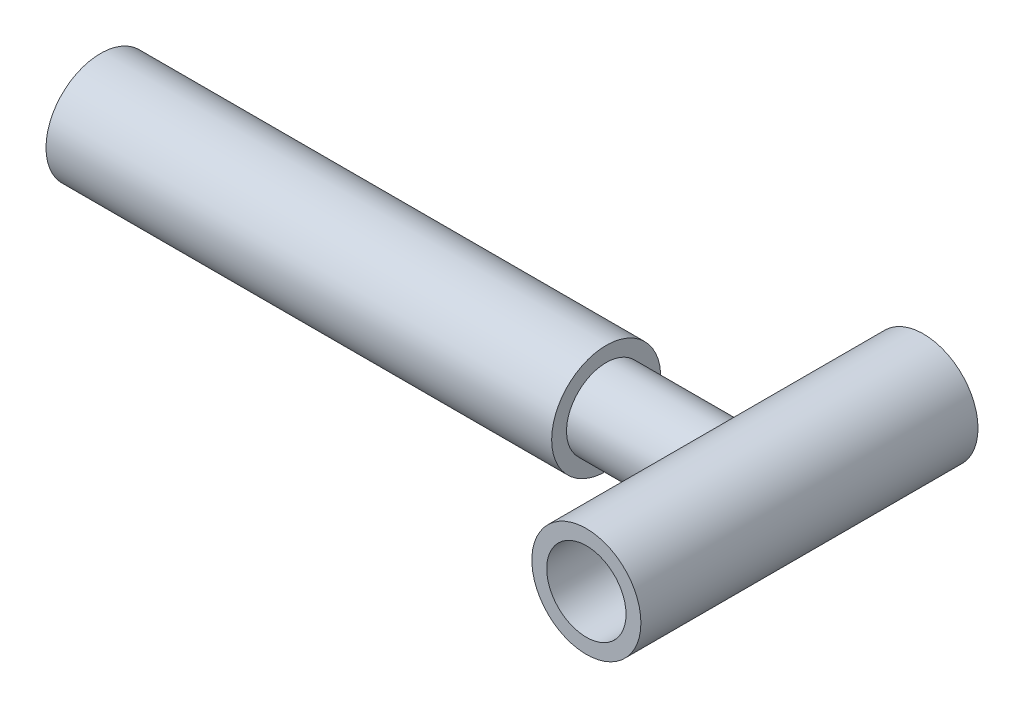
ISO-10303-21;
HEADER;
FILE_DESCRIPTION(('STEP AP214'),'2;1');
FILE_NAME('part.step','',(''),(''),'','','');
FILE_SCHEMA(('AUTOMOTIVE_DESIGN { 1 0 10303 214 1 1 1 1 }'));
ENDSEC;
DATA;
#1=APPLICATION_CONTEXT('core data for automotive mechanical design processes');
#2=APPLICATION_PROTOCOL_DEFINITION('international standard','automotive_design',2000,#1);
#3=PRODUCT_CONTEXT('',#1,'mechanical');
#4=PRODUCT('Part','Part','',(#3));
#5=PRODUCT_RELATED_PRODUCT_CATEGORY('part','',(#4));
#6=PRODUCT_DEFINITION_FORMATION('','',#4);
#7=PRODUCT_DEFINITION_CONTEXT('part definition',#1,'design');
#8=PRODUCT_DEFINITION('design','',#6,#7);
#9=PRODUCT_DEFINITION_SHAPE('','',#8);
#10=(LENGTH_UNIT() NAMED_UNIT(*) SI_UNIT(.MILLI.,.METRE.));
#11=(NAMED_UNIT(*) PLANE_ANGLE_UNIT() SI_UNIT($,.RADIAN.));
#12=(NAMED_UNIT(*) SI_UNIT($,.STERADIAN.) SOLID_ANGLE_UNIT());
#13=UNCERTAINTY_MEASURE_WITH_UNIT(LENGTH_MEASURE(1.E-05),#10,'distance_accuracy_value','');
#14=(GEOMETRIC_REPRESENTATION_CONTEXT(3) GLOBAL_UNCERTAINTY_ASSIGNED_CONTEXT((#13)) GLOBAL_UNIT_ASSIGNED_CONTEXT((#10,
#11,#12)) REPRESENTATION_CONTEXT('',''));
#15=CARTESIAN_POINT('',(0.,0.,0.));
#16=DIRECTION('',(0.,0.,1.));
#17=DIRECTION('',(1.,0.,0.));
#18=AXIS2_PLACEMENT_3D('',#15,#16,#17);
#19=CARTESIAN_POINT('',(0.,0.,0.));
#20=DIRECTION('',(1.,0.,0.));
#21=DIRECTION('',(0.,0.,-1.));
#22=AXIS2_PLACEMENT_3D('',#19,#20,#21);
#23=CYLINDRICAL_SURFACE('',#22,20.32);
#24=CARTESIAN_POINT('',(48.26,0.,-20.32));
#25=CARTESIAN_POINT('',(48.2600047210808,0.499914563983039,-20.319995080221));
#26=CARTESIAN_POINT('',(48.2734506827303,0.99997739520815,-20.3015175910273));
#27=CARTESIAN_POINT('',(48.3269310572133,1.99618720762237,-20.2278865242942));
#28=CARTESIAN_POINT('',(48.366982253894,2.49233151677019,-20.1727097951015));
#29=CARTESIAN_POINT('',(48.4728399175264,3.47768027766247,-20.0264016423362));
#30=CARTESIAN_POINT('',(48.5387055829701,3.96686608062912,-19.9351875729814));
#31=CARTESIAN_POINT('',(48.694650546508,4.93345998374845,-19.718233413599));
#32=CARTESIAN_POINT('',(48.7847263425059,5.41086977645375,-19.5924983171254));
#33=CARTESIAN_POINT('',(48.9865226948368,6.34812576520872,-19.3091164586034));
#34=CARTESIAN_POINT('',(49.0981103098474,6.80806006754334,-19.1516654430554));
#35=CARTESIAN_POINT('',(49.3410408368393,7.71093407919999,-18.8063167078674));
#36=CARTESIAN_POINT('',(49.4723844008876,8.15387322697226,-18.6184179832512));
#37=CARTESIAN_POINT('',(49.7523210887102,9.02059776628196,-18.2142732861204));
#38=CARTESIAN_POINT('',(49.9009047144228,9.44439352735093,-17.9980429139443));
#39=CARTESIAN_POINT('',(50.2128653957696,10.2717055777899,-17.5390508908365));
#40=CARTESIAN_POINT('',(50.3762443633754,10.675219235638,-17.2962858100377));
#41=CARTESIAN_POINT('',(50.7306034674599,11.4965747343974,-16.7628240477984));
#42=CARTESIAN_POINT('',(50.9227427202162,11.9123887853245,-16.4697765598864));
#43=CARTESIAN_POINT('',(51.3181410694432,12.7176226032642,-15.8562522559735));
#44=CARTESIAN_POINT('',(51.5214007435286,13.1070409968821,-15.5357740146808));
#45=CARTESIAN_POINT('',(51.9358866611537,13.8593322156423,-14.8685729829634));
#46=CARTESIAN_POINT('',(52.1471241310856,14.222165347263,-14.521812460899));
#47=CARTESIAN_POINT('',(52.5737020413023,14.9200854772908,-13.8037734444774));
#48=CARTESIAN_POINT('',(52.7890427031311,15.2551709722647,-13.4324936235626));
#49=CARTESIAN_POINT('',(53.2612610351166,15.958375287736,-12.5931333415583));
#50=CARTESIAN_POINT('',(53.5182135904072,16.3205725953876,-12.1201117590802));
#51=CARTESIAN_POINT('',(54.0256484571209,17.0036121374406,-11.1416231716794));
#52=CARTESIAN_POINT('',(54.2761289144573,17.3244426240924,-10.6361470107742));
#53=CARTESIAN_POINT('',(54.7623367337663,17.9225677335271,-9.59397562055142));
#54=CARTESIAN_POINT('',(54.9980808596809,18.1999123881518,-9.05731725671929));
#55=CARTESIAN_POINT('',(55.3336963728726,18.5814355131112,-8.22951338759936));
#56=CARTESIAN_POINT('',(55.4425495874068,18.70284160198,-7.94983000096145));
#57=CARTESIAN_POINT('',(55.6530214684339,18.9338233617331,-7.3828491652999));
#58=CARTESIAN_POINT('',(55.7546384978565,19.043396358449,-7.0955500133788));
#59=CARTESIAN_POINT('',(55.9823743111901,19.2854206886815,-6.41453609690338));
#60=CARTESIAN_POINT('',(56.1050540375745,19.4129577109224,-6.01789715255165));
#61=CARTESIAN_POINT('',(56.3313537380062,19.6445088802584,-5.2125927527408));
#62=CARTESIAN_POINT('',(56.4349796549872,19.7485303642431,-4.80393109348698));
#63=CARTESIAN_POINT('',(56.6195565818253,19.9315513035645,-3.9767704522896));
#64=CARTESIAN_POINT('',(56.7005489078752,20.0105963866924,-3.55829092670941));
#65=CARTESIAN_POINT('',(56.8369405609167,20.1426061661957,-2.7130665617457));
#66=CARTESIAN_POINT('',(56.892339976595,20.1955709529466,-2.28632175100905));
#67=CARTESIAN_POINT('',(56.9754118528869,20.2746681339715,-1.42438679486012));
#68=CARTESIAN_POINT('',(57.0028743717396,20.3005973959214,-0.989157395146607));
#69=CARTESIAN_POINT('',(57.0280162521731,20.3243437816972,-0.117076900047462));
#70=CARTESIAN_POINT('',(57.0256967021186,20.3221619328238,0.319774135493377));
#71=CARTESIAN_POINT('',(56.9913797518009,20.2897277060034,1.19152333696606));
#72=CARTESIAN_POINT('',(56.9593635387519,20.2594575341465,1.6264200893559));
#73=CARTESIAN_POINT('',(56.8671609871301,20.1714884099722,2.49040029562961));
#74=CARTESIAN_POINT('',(56.806971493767,20.1137863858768,2.91948309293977));
#75=CARTESIAN_POINT('',(56.6526547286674,19.9639109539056,3.81774418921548));
#76=CARTESIAN_POINT('',(56.5554178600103,19.8685335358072,4.2858507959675));
#77=CARTESIAN_POINT('',(56.3338296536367,19.6469677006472,5.20808211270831));
#78=CARTESIAN_POINT('',(56.2094743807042,19.5207748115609,5.66220478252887));
#79=CARTESIAN_POINT('',(55.9383865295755,19.2392522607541,6.55540145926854));
#80=CARTESIAN_POINT('',(55.7916115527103,19.0838672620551,6.9944449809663));
#81=CARTESIAN_POINT('',(55.4807092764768,18.7458618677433,7.85551104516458));
#82=CARTESIAN_POINT('',(55.3165803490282,18.5632389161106,8.27753198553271));
#83=CARTESIAN_POINT('',(54.9179655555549,18.1063184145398,9.243224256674));
#84=CARTESIAN_POINT('',(54.6783984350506,17.8218583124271,9.78000745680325));
#85=CARTESIAN_POINT('',(54.1855529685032,17.2093687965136,10.8215149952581));
#86=CARTESIAN_POINT('',(53.9322703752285,16.8813258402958,11.3262292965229));
#87=CARTESIAN_POINT('',(53.4197986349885,16.1831311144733,12.3032287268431));
#88=CARTESIAN_POINT('',(53.160604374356,15.8129416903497,12.7754842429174));
#89=CARTESIAN_POINT('',(52.6436142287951,15.0319534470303,13.6858468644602));
#90=CARTESIAN_POINT('',(52.3858181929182,14.6211591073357,14.1239577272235));
#91=CARTESIAN_POINT('',(51.8747887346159,13.7544162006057,14.969622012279));
#92=CARTESIAN_POINT('',(51.6216545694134,13.2979612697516,15.3767176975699));
#93=CARTESIAN_POINT('',(51.1296708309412,12.3454298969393,16.1514615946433));
#94=CARTESIAN_POINT('',(50.8908227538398,11.849349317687,16.5191056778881));
#95=CARTESIAN_POINT('',(50.4339932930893,10.8200129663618,17.2108456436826));
#96=CARTESIAN_POINT('',(50.2159722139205,10.2868314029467,17.5350248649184));
#97=CARTESIAN_POINT('',(49.9088578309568,9.46075321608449,17.9859667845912));
#98=CARTESIAN_POINT('',(49.8098141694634,9.18103666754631,18.1303811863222));
#99=CARTESIAN_POINT('',(49.6190263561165,8.6130821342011,18.4069823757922));
#100=CARTESIAN_POINT('',(49.5272840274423,8.32484204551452,18.5391661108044));
#101=CARTESIAN_POINT('',(49.3091412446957,7.59809282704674,18.8519248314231));
#102=CARTESIAN_POINT('',(49.1876073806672,7.15473247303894,19.0247360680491));
#103=CARTESIAN_POINT('',(48.964634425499,6.25254655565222,19.3400194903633));
#104=CARTESIAN_POINT('',(48.8631909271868,5.79372440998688,19.4824983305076));
#105=CARTESIAN_POINT('',(48.6824306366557,4.86327172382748,19.7353296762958));
#106=CARTESIAN_POINT('',(48.6031022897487,4.39164801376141,19.8456989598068));
#107=CARTESIAN_POINT('',(48.4682006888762,3.43840217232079,20.0328656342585));
#108=CARTESIAN_POINT('',(48.4126280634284,2.95677977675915,20.1096621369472));
#109=CARTESIAN_POINT('',(48.326336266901,1.98523511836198,20.2287326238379));
#110=CARTESIAN_POINT('',(48.2957098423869,1.49528873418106,20.2708777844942));
#111=CARTESIAN_POINT('',(48.2603789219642,0.512689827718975,20.3194858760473));
#112=CARTESIAN_POINT('',(48.2556743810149,0.0200373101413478,20.3259488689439));
#113=CARTESIAN_POINT('',(48.2722994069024,-0.964011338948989,20.3030864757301));
#114=CARTESIAN_POINT('',(48.2936301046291,-1.45540741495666,20.2737595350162));
#115=CARTESIAN_POINT('',(48.361821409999,-2.43300024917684,20.1797926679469));
#116=CARTESIAN_POINT('',(48.4086813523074,-2.91919714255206,20.1151536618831));
#117=CARTESIAN_POINT('',(48.5235052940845,-3.85552230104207,19.9562018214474));
#118=CARTESIAN_POINT('',(48.5901289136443,-4.30613751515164,19.8637696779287));
#119=CARTESIAN_POINT('',(48.743822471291,-5.19674046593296,19.6495813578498));
#120=CARTESIAN_POINT('',(48.8308914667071,-5.63672869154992,19.5278265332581));
#121=CARTESIAN_POINT('',(49.0238770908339,-6.5037872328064,19.2564160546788));
#122=CARTESIAN_POINT('',(49.1297955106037,-6.93085631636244,19.1067577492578));
#123=CARTESIAN_POINT('',(49.3586507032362,-7.770122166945,18.7811140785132));
#124=CARTESIAN_POINT('',(49.4815884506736,-8.18231808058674,18.6051272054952));
#125=CARTESIAN_POINT('',(49.7534058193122,-9.02401268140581,18.2127103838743));
#126=CARTESIAN_POINT('',(49.9035940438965,-9.45208592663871,17.9941312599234));
#127=CARTESIAN_POINT('',(50.2190316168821,-10.287481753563,17.5299319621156));
#128=CARTESIAN_POINT('',(50.3842816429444,-10.6948034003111,17.2843105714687));
#129=CARTESIAN_POINT('',(50.7272581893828,-11.4878081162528,16.7677282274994));
#130=CARTESIAN_POINT('',(50.9049906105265,-11.8734807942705,16.4967552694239));
#131=CARTESIAN_POINT('',(51.2701736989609,-12.6222388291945,15.9311543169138));
#132=CARTESIAN_POINT('',(51.457625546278,-12.985321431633,15.6365234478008));
#133=CARTESIAN_POINT('',(51.8744203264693,-13.7525843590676,14.9690521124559));
#134=CARTESIAN_POINT('',(52.1051568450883,-14.1521437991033,14.5917605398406));
#135=CARTESIAN_POINT('',(52.5717261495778,-14.9180901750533,13.8077305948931));
#136=CARTESIAN_POINT('',(52.8075597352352,-15.2844718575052,13.4009875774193));
#137=CARTESIAN_POINT('',(53.2795219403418,-15.9835308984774,12.5590124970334));
#138=CARTESIAN_POINT('',(53.5156506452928,-16.3161812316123,12.1237580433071));
#139=CARTESIAN_POINT('',(53.9825459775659,-16.9464472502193,11.2259131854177));
#140=CARTESIAN_POINT('',(54.2133133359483,-17.2440677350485,10.7633265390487));
#141=CARTESIAN_POINT('',(54.6362555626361,-17.769304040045,9.8686344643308));
#142=CARTESIAN_POINT('',(54.8297328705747,-18.0010341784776,9.43955937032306));
#143=CARTESIAN_POINT('',(55.2030213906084,-18.4350864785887,8.56096038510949));
#144=CARTESIAN_POINT('',(55.382832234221,-18.6374078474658,8.11143594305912));
#145=CARTESIAN_POINT('',(55.7230835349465,-19.0106068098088,7.19335393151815));
#146=CARTESIAN_POINT('',(55.883556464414,-19.1815373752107,6.72483008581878));
#147=CARTESIAN_POINT('',(56.1795095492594,-19.4902373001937,5.76930628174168));
#148=CARTESIAN_POINT('',(56.3149970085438,-19.6280163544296,5.28231177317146));
#149=CARTESIAN_POINT('',(56.5289860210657,-19.8421907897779,4.398822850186));
#150=CARTESIAN_POINT('',(56.6134761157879,-19.9254156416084,4.00542895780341));
#151=CARTESIAN_POINT('',(56.7604679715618,-20.0688509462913,3.2104036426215));
#152=CARTESIAN_POINT('',(56.8229726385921,-20.1290644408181,2.80877331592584));
#153=CARTESIAN_POINT('',(56.923568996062,-20.2254217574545,2.00007727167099));
#154=CARTESIAN_POINT('',(56.9616904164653,-20.2615948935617,1.59301879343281));
#155=CARTESIAN_POINT('',(57.0120647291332,-20.3093073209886,0.775840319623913));
#156=CARTESIAN_POINT('',(57.0243174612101,-20.3208464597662,0.365720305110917));
#157=CARTESIAN_POINT('',(57.0224196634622,-20.3190554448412,-0.455015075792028));
#158=CARTESIAN_POINT('',(57.0082297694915,-20.3056882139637,-0.865630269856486));
#159=CARTESIAN_POINT('',(56.9539867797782,-20.2542822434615,-1.68356499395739));
#160=CARTESIAN_POINT('',(56.9139337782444,-20.2162435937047,-2.09088453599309));
#161=CARTESIAN_POINT('',(56.8095465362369,-20.1161407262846,-2.89994459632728));
#162=CARTESIAN_POINT('',(56.7451793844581,-20.0540439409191,-3.30167678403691));
#163=CARTESIAN_POINT('',(56.5945959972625,-19.9068526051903,-4.09672488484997));
#164=CARTESIAN_POINT('',(56.5083767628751,-19.8217548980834,-4.4900396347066));
#165=CARTESIAN_POINT('',(56.2877552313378,-19.6004436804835,-5.38491294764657));
#166=CARTESIAN_POINT('',(56.146676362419,-19.4565558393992,-5.88293622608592));
#167=CARTESIAN_POINT('',(55.838812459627,-19.1341384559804,-6.85943066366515));
#168=CARTESIAN_POINT('',(55.6720187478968,-18.9555972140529,-7.33789515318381));
#169=CARTESIAN_POINT('',(55.3188819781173,-18.565875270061,-8.2745583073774));
#170=CARTESIAN_POINT('',(55.1325142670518,-18.3546532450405,-8.73273035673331));
#171=CARTESIAN_POINT('',(54.7461544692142,-17.9015295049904,-9.62752052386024));
#172=CARTESIAN_POINT('',(54.5461633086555,-17.6596298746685,-10.0641401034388));
#173=CARTESIAN_POINT('',(54.1315996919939,-17.1389402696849,-10.9279852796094));
#174=CARTESIAN_POINT('',(53.9167716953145,-16.8592770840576,-11.3545608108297));
#175=CARTESIAN_POINT('',(53.4828626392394,-16.2698866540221,-12.1840905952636));
#176=CARTESIAN_POINT('',(53.2637815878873,-15.9601594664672,-12.5870448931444));
#177=CARTESIAN_POINT('',(52.8256181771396,-15.3112764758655,-13.3688194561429));
#178=CARTESIAN_POINT('',(52.6065358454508,-14.9721101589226,-13.7476310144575));
#179=CARTESIAN_POINT('',(52.1724248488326,-14.2650411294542,-14.4799899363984));
#180=CARTESIAN_POINT('',(51.9573966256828,-13.8971353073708,-14.8335345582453));
#181=CARTESIAN_POINT('',(51.4891915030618,-13.0499768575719,-15.5880882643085));
#182=CARTESIAN_POINT('',(51.2378992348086,-12.5639191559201,-15.982677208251));
#183=CARTESIAN_POINT('',(50.7534801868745,-11.5513326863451,-16.7291590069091));
#184=CARTESIAN_POINT('',(50.520357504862,-11.0247948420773,-17.0810422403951));
#185=CARTESIAN_POINT('',(50.0790086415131,-9.93394397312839,-17.7376433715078));
#186=CARTESIAN_POINT('',(49.870757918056,-9.36966905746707,-18.0424078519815));
#187=CARTESIAN_POINT('',(49.4852849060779,-8.20625218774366,-18.600416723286));
#188=CARTESIAN_POINT('',(49.3080464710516,-7.60712859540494,-18.853687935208));
#189=CARTESIAN_POINT('',(49.0356897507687,-6.55363076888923,-19.239841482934));
#190=CARTESIAN_POINT('',(48.9315543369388,-6.10657201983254,-19.3864741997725));
#191=CARTESIAN_POINT('',(48.7441111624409,-5.19925008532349,-19.6492528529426));
#192=CARTESIAN_POINT('',(48.6608027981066,-4.73898728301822,-19.7653996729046));
#193=CARTESIAN_POINT('',(48.5169109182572,-3.80931657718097,-19.9653957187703));
#194=CARTESIAN_POINT('',(48.4562675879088,-3.33993623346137,-20.0493299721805));
#195=CARTESIAN_POINT('',(48.3587139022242,-2.39418248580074,-20.1841073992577));
#196=CARTESIAN_POINT('',(48.3217906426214,-1.91781302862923,-20.2349685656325));
#197=CARTESIAN_POINT('',(48.2847673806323,-1.20038726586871,-20.2859341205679));
#198=CARTESIAN_POINT('',(48.2754865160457,-0.960614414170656,-20.2987016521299));
#199=CARTESIAN_POINT('',(48.2631012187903,-0.480572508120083,-20.3157364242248));
#200=CARTESIAN_POINT('',(48.2599977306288,-0.240303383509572,-20.3200023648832));
#201=CARTESIAN_POINT('',(48.26,0.,-20.32));
#202=B_SPLINE_CURVE_WITH_KNOTS('',3,(#24,#25,#26,#27,#28,#29,#30,#31,#32,#33,#34,#35,#36,#37,
#38,#39,#40,#41,#42,#43,#44,#45,#46,#47,#48,#49,#50,#51,#52,#53,#54,#55,#56,#57,#58,#59,#60,#61,
#62,#63,#64,#65,#66,#67,#68,#69,#70,#71,#72,#73,#74,#75,#76,#77,#78,#79,#80,#81,#82,#83,#84,#85,
#86,#87,#88,#89,#90,#91,#92,#93,#94,#95,#96,#97,#98,#99,#100,#101,#102,#103,#104,#105,#106,#107,
#108,#109,#110,#111,#112,#113,#114,#115,#116,#117,#118,#119,#120,#121,#122,#123,#124,#125,#126,
#127,#128,#129,#130,#131,#132,#133,#134,#135,#136,#137,#138,#139,#140,#141,#142,#143,#144,#145,
#146,#147,#148,#149,#150,#151,#152,#153,#154,#155,#156,#157,#158,#159,#160,#161,#162,#163,#164,
#165,#166,#167,#168,#169,#170,#171,#172,#173,#174,#175,#176,#177,#178,#179,#180,#181,#182,#183,
#184,#185,#186,#187,#188,#189,#190,#191,#192,#193,#194,#195,#196,#197,#198,#199,#200,#201),
.UNSPECIFIED.,.T.,.F.,(4,2,2,2,2,2,2,2,2,2,2,2,2,2,2,2,2,2,2,2,2,2,2,2,2,2,2,2,2,2,2,2,2,2,2,2,
2,2,2,2,2,2,2,2,2,2,2,2,2,2,2,2,2,2,2,2,2,2,2,2,2,2,2,2,2,2,2,2,2,2,2,2,2,2,2,2,2,2,2,2,2,2,2,2,
2,2,2,2,4),(0.,1.49948350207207,2.99991384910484,4.50380535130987,6.00747942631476,
7.50214270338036,8.99685532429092,10.4907483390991,11.984834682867,13.6146338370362,
15.2445177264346,16.8767875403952,18.5091457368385,20.4533981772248,22.3982015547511,
24.3407506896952,25.311665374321,26.2827990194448,27.5846123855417,28.8860190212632,
30.1850342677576,31.4840450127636,32.7927470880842,34.1014013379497,35.4108851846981,
36.7205157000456,38.1809335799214,39.6415635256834,41.104990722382,42.5685553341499,
44.5249437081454,46.4819414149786,48.4407014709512,50.3992456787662,52.3826161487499,
54.3661939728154,56.3459124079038,57.3355881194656,58.3255101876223,59.7972827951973,
61.2687321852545,62.7394113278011,64.2101293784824,65.6862907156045,67.1624494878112,
68.638672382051,70.1148568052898,71.5077256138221,72.9005302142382,74.293467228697,
75.6864840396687,77.1957174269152,78.7050187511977,80.2150384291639,81.7252418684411,
83.5115243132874,85.2980891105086,87.0860741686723,88.8738139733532,90.4464305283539,
92.0190894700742,93.5890696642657,95.158590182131,96.3900480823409,97.6213431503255,
98.8511340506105,100.080932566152,101.312563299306,102.544189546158,103.777488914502,
105.01095763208,106.620273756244,108.230134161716,109.842047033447,111.453850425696,
113.112879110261,114.771904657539,116.431525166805,118.091325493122,120.112425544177,
122.133980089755,124.15352311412,126.172011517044,127.616204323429,129.06035526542,
130.500667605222,131.940195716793,132.660870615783,133.381655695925),.UNSPECIFIED.);
#203=CARTESIAN_POINT('',(48.26,0.,-20.32));
#204=VERTEX_POINT('',#203);
#205=EDGE_CURVE('E10',#204,#204,#202,.T.);
#206=ORIENTED_EDGE('',*,*,#205,.F.);
#207=EDGE_LOOP('',(#206));
#208=FACE_BOUND('',#207,.T.);
#209=CARTESIAN_POINT('',(0.,0.,0.));
#210=DIRECTION('',(1.,0.,0.));
#211=DIRECTION('',(0.,0.,-1.));
#212=AXIS2_PLACEMENT_3D('',#209,#210,#211);
#213=CIRCLE('',#212,20.32);
#214=CARTESIAN_POINT('',(0.,0.,-20.32));
#215=VERTEX_POINT('',#214);
#216=EDGE_CURVE('E63',#215,#215,#213,.T.);
#217=ORIENTED_EDGE('',*,*,#216,.T.);
#218=EDGE_LOOP('',(#217));
#219=FACE_BOUND('',#218,.T.);
#220=ADVANCED_FACE('F39',(#208,#219),#23,.T.);
#221=CARTESIAN_POINT('',(76.2,0.,-165.386253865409));
#222=DIRECTION('',(0.,0.,1.));
#223=DIRECTION('',(1.,0.,0.));
#224=AXIS2_PLACEMENT_3D('',#221,#222,#223);
#225=CYLINDRICAL_SURFACE('',#224,27.94);
#226=ORIENTED_EDGE('',*,*,#205,.T.);
#227=EDGE_LOOP('',(#226));
#228=FACE_BOUND('',#227,.T.);
#229=CARTESIAN_POINT('',(76.2,0.,-86.36));
#230=DIRECTION('',(0.,0.,1.));
#231=DIRECTION('',(1.,0.,0.));
#232=AXIS2_PLACEMENT_3D('',#229,#230,#231);
#233=CIRCLE('',#232,27.94);
#234=CARTESIAN_POINT('',(104.14,0.,-86.36));
#235=VERTEX_POINT('',#234);
#236=EDGE_CURVE('E51',#235,#235,#233,.F.);
#237=ORIENTED_EDGE('',*,*,#236,.F.);
#238=EDGE_LOOP('',(#237));
#239=FACE_BOUND('',#238,.T.);
#240=CARTESIAN_POINT('',(76.2,0.,86.36));
#241=DIRECTION('',(0.,0.,1.));
#242=DIRECTION('',(1.,0.,0.));
#243=AXIS2_PLACEMENT_3D('',#240,#241,#242);
#244=CIRCLE('',#243,27.94);
#245=CARTESIAN_POINT('',(104.14,0.,86.36));
#246=VERTEX_POINT('',#245);
#247=EDGE_CURVE('E55',#246,#246,#244,.T.);
#248=ORIENTED_EDGE('',*,*,#247,.F.);
#249=EDGE_LOOP('',(#248));
#250=FACE_BOUND('',#249,.T.);
#251=ADVANCED_FACE('F98',(#228,#239,#250),#225,.T.);
#252=CARTESIAN_POINT('',(76.2,0.,-86.36));
#253=DIRECTION('',(0.,0.,1.));
#254=DIRECTION('',(1.,0.,0.));
#255=AXIS2_PLACEMENT_3D('',#252,#253,#254);
#256=PLANE('',#255);
#257=CARTESIAN_POINT('',(76.2,0.,-86.36));
#258=DIRECTION('',(0.,0.,1.));
#259=DIRECTION('',(1.,0.,0.));
#260=AXIS2_PLACEMENT_3D('',#257,#258,#259);
#261=CIRCLE('',#260,20.32);
#262=CARTESIAN_POINT('',(96.52,0.,-86.36));
#263=VERTEX_POINT('',#262);
#264=EDGE_CURVE('E60',#263,#263,#261,.T.);
#265=ORIENTED_EDGE('',*,*,#264,.T.);
#266=EDGE_LOOP('',(#265));
#267=FACE_BOUND('',#266,.T.);
#268=ORIENTED_EDGE('',*,*,#236,.T.);
#269=EDGE_LOOP('',(#268));
#270=FACE_BOUND('',#269,.T.);
#271=ADVANCED_FACE('F85',(#267,#270),#256,.F.);
#272=CARTESIAN_POINT('',(76.2,0.,86.36));
#273=DIRECTION('',(0.,0.,1.));
#274=DIRECTION('',(1.,0.,0.));
#275=AXIS2_PLACEMENT_3D('',#272,#273,#274);
#276=PLANE('',#275);
#277=CARTESIAN_POINT('',(76.2,0.,86.36));
#278=DIRECTION('',(0.,0.,1.));
#279=DIRECTION('',(1.,0.,0.));
#280=AXIS2_PLACEMENT_3D('',#277,#278,#279);
#281=CIRCLE('',#280,20.32);
#282=CARTESIAN_POINT('',(96.52,0.,86.36));
#283=VERTEX_POINT('',#282);
#284=EDGE_CURVE('E65',#283,#283,#281,.T.);
#285=ORIENTED_EDGE('',*,*,#284,.F.);
#286=EDGE_LOOP('',(#285));
#287=FACE_BOUND('',#286,.T.);
#288=ORIENTED_EDGE('',*,*,#247,.T.);
#289=EDGE_LOOP('',(#288));
#290=FACE_BOUND('',#289,.T.);
#291=ADVANCED_FACE('F41',(#287,#290),#276,.T.);
#292=CARTESIAN_POINT('',(76.2,0.,-86.36));
#293=DIRECTION('',(0.,0.,1.));
#294=DIRECTION('',(1.,0.,0.));
#295=AXIS2_PLACEMENT_3D('',#292,#293,#294);
#296=CYLINDRICAL_SURFACE('',#295,20.32);
#297=ORIENTED_EDGE('',*,*,#264,.F.);
#298=EDGE_LOOP('',(#297));
#299=FACE_BOUND('',#298,.T.);
#300=ORIENTED_EDGE('',*,*,#284,.T.);
#301=EDGE_LOOP('',(#300));
#302=FACE_BOUND('',#301,.T.);
#303=ADVANCED_FACE('F87',(#299,#302),#296,.F.);
#304=CARTESIAN_POINT('',(-259.08,0.,0.));
#305=DIRECTION('',(1.,0.,0.));
#306=DIRECTION('',(0.,0.,-1.));
#307=AXIS2_PLACEMENT_3D('',#304,#305,#306);
#308=CYLINDRICAL_SURFACE('',#307,27.94);
#309=CARTESIAN_POINT('',(-259.08,0.,0.));
#310=DIRECTION('',(-1.,0.,0.));
#311=DIRECTION('',(0.,0.,1.));
#312=AXIS2_PLACEMENT_3D('',#309,#310,#311);
#313=CIRCLE('',#312,27.94);
#314=CARTESIAN_POINT('',(-259.08,0.,27.94));
#315=VERTEX_POINT('',#314);
#316=EDGE_CURVE('E66',#315,#315,#313,.T.);
#317=ORIENTED_EDGE('',*,*,#316,.F.);
#318=EDGE_LOOP('',(#317));
#319=FACE_BOUND('',#318,.T.);
#320=CARTESIAN_POINT('',(0.,0.,0.));
#321=DIRECTION('',(-1.,0.,0.));
#322=DIRECTION('',(0.,0.,1.));
#323=AXIS2_PLACEMENT_3D('',#320,#321,#322);
#324=CIRCLE('',#323,27.94);
#325=CARTESIAN_POINT('',(0.,0.,27.94));
#326=VERTEX_POINT('',#325);
#327=EDGE_CURVE('E71',#326,#326,#324,.T.);
#328=ORIENTED_EDGE('',*,*,#327,.T.);
#329=EDGE_LOOP('',(#328));
#330=FACE_BOUND('',#329,.T.);
#331=ADVANCED_FACE('F90',(#319,#330),#308,.T.);
#332=CARTESIAN_POINT('',(-259.08,0.,0.));
#333=DIRECTION('',(-1.,0.,0.));
#334=DIRECTION('',(0.,0.,1.));
#335=AXIS2_PLACEMENT_3D('',#332,#333,#334);
#336=PLANE('',#335);
#337=CARTESIAN_POINT('',(-259.08,0.,0.));
#338=DIRECTION('',(-1.,0.,0.));
#339=DIRECTION('',(0.,0.,1.));
#340=AXIS2_PLACEMENT_3D('',#337,#338,#339);
#341=CIRCLE('',#340,20.32);
#342=CARTESIAN_POINT('',(-259.08,0.,20.32));
#343=VERTEX_POINT('',#342);
#344=EDGE_CURVE('E79',#343,#343,#341,.T.);
#345=ORIENTED_EDGE('',*,*,#344,.F.);
#346=EDGE_LOOP('',(#345));
#347=FACE_BOUND('',#346,.T.);
#348=ORIENTED_EDGE('',*,*,#316,.T.);
#349=EDGE_LOOP('',(#348));
#350=FACE_BOUND('',#349,.T.);
#351=ADVANCED_FACE('F111',(#347,#350),#336,.T.);
#352=CARTESIAN_POINT('',(0.,0.,0.));
#353=DIRECTION('',(-1.,0.,0.));
#354=DIRECTION('',(0.,0.,1.));
#355=AXIS2_PLACEMENT_3D('',#352,#353,#354);
#356=PLANE('',#355);
#357=ORIENTED_EDGE('',*,*,#216,.F.);
#358=EDGE_LOOP('',(#357));
#359=FACE_BOUND('',#358,.T.);
#360=ORIENTED_EDGE('',*,*,#327,.F.);
#361=EDGE_LOOP('',(#360));
#362=FACE_BOUND('',#361,.T.);
#363=ADVANCED_FACE('F113',(#359,#362),#356,.F.);
#364=CARTESIAN_POINT('',(-5.07999999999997,0.,0.));
#365=DIRECTION('',(-1.,0.,0.));
#366=DIRECTION('',(0.,0.,1.));
#367=AXIS2_PLACEMENT_3D('',#364,#365,#366);
#368=CYLINDRICAL_SURFACE('',#367,20.32);
#369=CARTESIAN_POINT('',(-5.07999999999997,0.,0.));
#370=DIRECTION('',(-1.,0.,0.));
#371=DIRECTION('',(0.,0.,1.));
#372=AXIS2_PLACEMENT_3D('',#369,#370,#371);
#373=CIRCLE('',#372,20.32);
#374=CARTESIAN_POINT('',(-5.07999999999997,0.,20.32));
#375=VERTEX_POINT('',#374);
#376=EDGE_CURVE('E76',#375,#375,#373,.T.);
#377=ORIENTED_EDGE('',*,*,#376,.F.);
#378=EDGE_LOOP('',(#377));
#379=FACE_BOUND('',#378,.T.);
#380=ORIENTED_EDGE('',*,*,#344,.T.);
#381=EDGE_LOOP('',(#380));
#382=FACE_BOUND('',#381,.T.);
#383=ADVANCED_FACE('F116',(#379,#382),#368,.F.);
#384=CARTESIAN_POINT('',(-5.07999999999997,0.,0.));
#385=DIRECTION('',(-1.,0.,0.));
#386=DIRECTION('',(0.,0.,1.));
#387=AXIS2_PLACEMENT_3D('',#384,#385,#386);
#388=PLANE('',#387);
#389=ORIENTED_EDGE('',*,*,#376,.T.);
#390=EDGE_LOOP('',(#389));
#391=FACE_BOUND('',#390,.T.);
#392=ADVANCED_FACE('F123',(#391),#388,.T.);
#393=CLOSED_SHELL('',(#220,#251,#271,#291,#303,#331,#351,#363,#383,#392));
#394=MANIFOLD_SOLID_BREP('B2',#393);
#395=ADVANCED_BREP_SHAPE_REPRESENTATION('',(#18,#394),#14);
#396=SHAPE_DEFINITION_REPRESENTATION(#9,#395);
ENDSEC;
END-ISO-10303-21;
